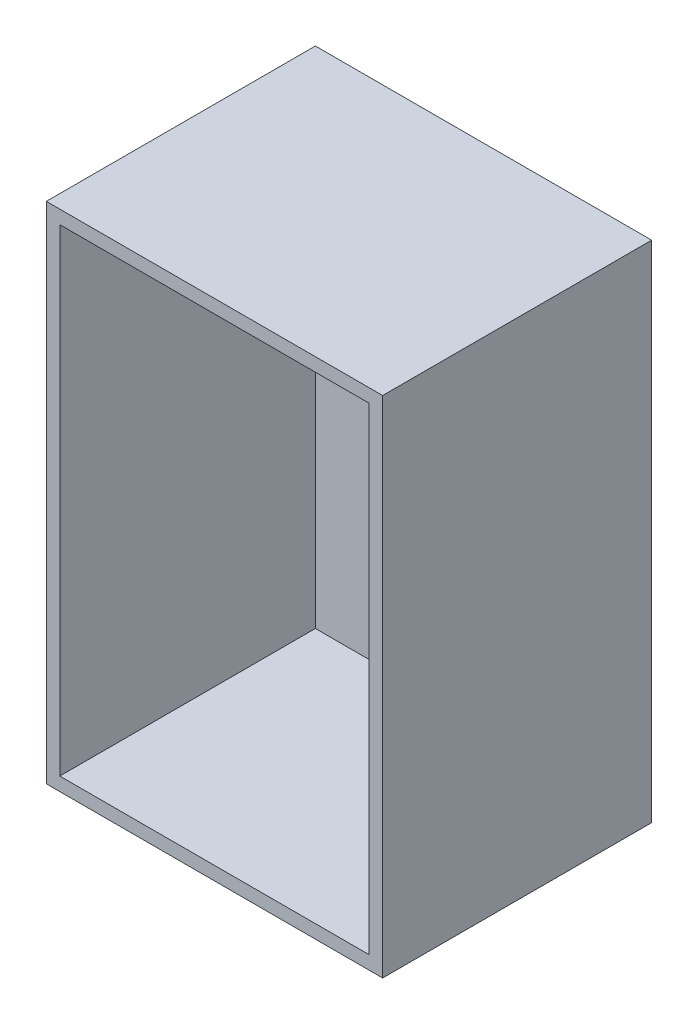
from build123d import *

# Parameters (mm, degrees)
SZKIC1_W                    = 100
SZKIC1_H                    = 150
DODANIE_WYCI_GNI_CIE1_DEPTH = 40
SKORUPA1_T                  = -4


with BuildPart() as part:
    # Szkic1 → Dodanie-wyci_gni_cie1 (new, symmetric)
    with BuildSketch(Plane.XY):
        Rectangle(SZKIC1_W, SZKIC1_H)
    extrude(amount=DODANIE_WYCI_GNI_CIE1_DEPTH, both=True)

    # Skorupa1
    skorupa1_openings = [part.faces().sort_by_distance(p)[0] for p in [
        (0, 0, 40),
    ]]
    offset(amount=SKORUPA1_T, openings=skorupa1_openings, kind=Kind.INTERSECTION)


solid = part.part
